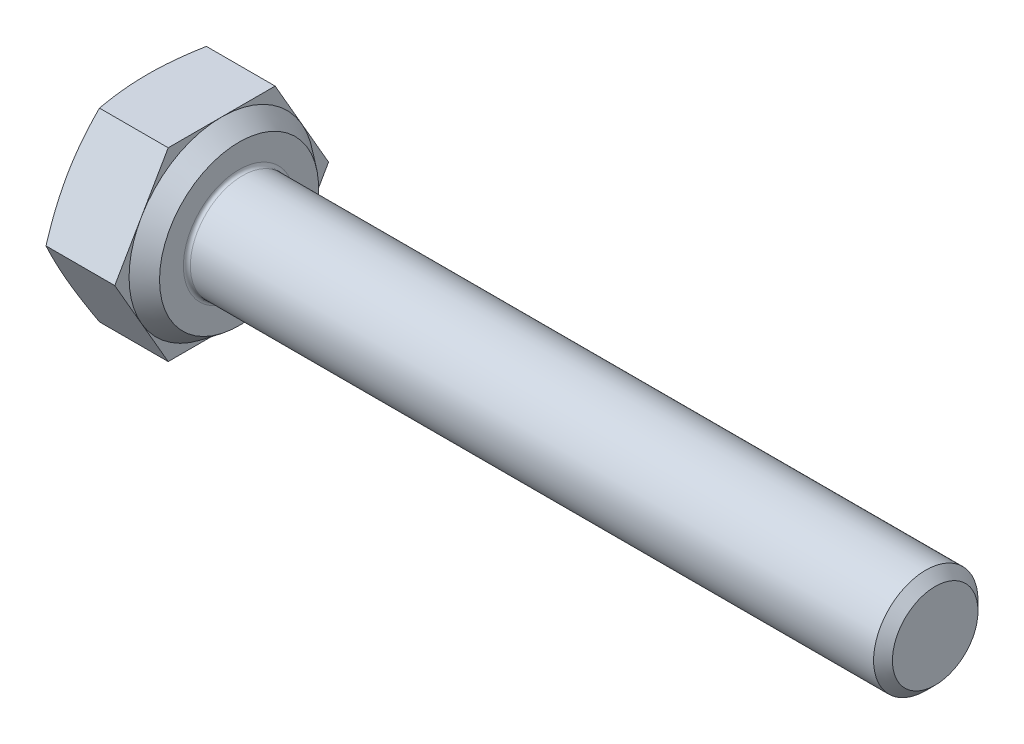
from build123d import *

# Parameters (mm, degrees)
BASEHEAD_DEPTH = 2.125
SKETCH3_R      = 1.5
BASEBODY_DEPTH = 20
HEADFILLET_R   = 0.1
CHAMFER1_SIZE  = 0.2705


with BuildPart() as part:
    # Sketch-BaseHead → BaseHead (new body)
    with BuildSketch(Plane(origin=(0, 0, 0), x_dir=(0, 0, -1), z_dir=(1, 0, 0))):
        Polygon((3.071503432, 0), (1.535751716, 2.66), (-1.535751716, 2.66), (-3.071503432, 0), (-1.535751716, -2.66), (1.535751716, -2.66), align=None)
    extrude(amount=BASEHEAD_DEPTH)

    # Sketch4 → HeadChamfer (revolve, cut)
    with BuildSketch(Plane(origin=(-0.264637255, 0, 5.916896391), x_dir=(0, 0, -1), z_dir=(0, 1, 0))):
        Polygon((8.988399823, -0.264637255), (8.576896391, -0.264637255), (8.988399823, -0.414412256), align=None)
    revolve(axis=Axis((-4.001564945, 0, 0), (1, 0, 0)), mode=Mode.SUBTRACT)

    # Sketch1 → Revolve1 (revolve)
    with BuildSketch(Plane.XY, mode=Mode.PRIVATE) as revolve1_sk:
        Polygon((2.125, 0), (2.625, 0), (2.625, -2.285), (2.125, -2.66), align=None)
    revolve(revolve1_sk.sketch.rotate(Axis((-4.001564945, 0, 0), (1, 0, 0)), 270), axis=Axis((-4.001564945, 0, 0), (1, 0, 0)))

    # Sketch3 → BaseBody (add)
    with BuildSketch(Plane(origin=(2.625, 0, 0), x_dir=(0, 0, -1), z_dir=(1, 0, 0))):
        Circle(SKETCH3_R)
    extrude(amount=BASEBODY_DEPTH)

    # HeadFillet
    headfillet_edges = [part.edges().sort_by_distance(p)[0] for p in [
        (2.625, 0, 1.5),
    ]]
    fillet(headfillet_edges, radius=HEADFILLET_R)

    # Chamfer1
    chamfer1_edges = [part.edges().sort_by_distance(p)[0] for p in [
        (22.625, 0, 1.5),
    ]]
    chamfer(chamfer1_edges, length=CHAMFER1_SIZE)


solid = part.part
